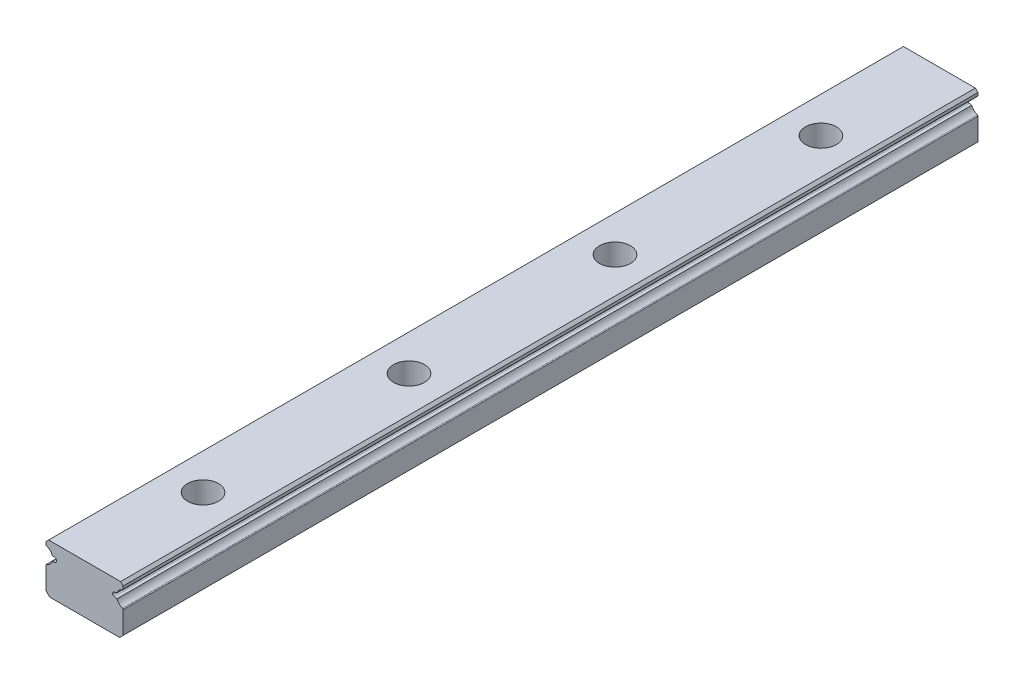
ISO-10303-21;
HEADER;
FILE_DESCRIPTION(('STEP AP214'),'2;1');
FILE_NAME('part.step','',(''),(''),'','','');
FILE_SCHEMA(('AUTOMOTIVE_DESIGN { 1 0 10303 214 1 1 1 1 }'));
ENDSEC;
DATA;
#1=APPLICATION_CONTEXT('core data for automotive mechanical design processes');
#2=APPLICATION_PROTOCOL_DEFINITION('international standard','automotive_design',2000,#1);
#3=PRODUCT_CONTEXT('',#1,'mechanical');
#4=PRODUCT('Part','Part','',(#3));
#5=PRODUCT_RELATED_PRODUCT_CATEGORY('part','',(#4));
#6=PRODUCT_DEFINITION_FORMATION('','',#4);
#7=PRODUCT_DEFINITION_CONTEXT('part definition',#1,'design');
#8=PRODUCT_DEFINITION('design','',#6,#7);
#9=PRODUCT_DEFINITION_SHAPE('','',#8);
#10=(LENGTH_UNIT() NAMED_UNIT(*) SI_UNIT(.MILLI.,.METRE.));
#11=(NAMED_UNIT(*) PLANE_ANGLE_UNIT() SI_UNIT($,.RADIAN.));
#12=(NAMED_UNIT(*) SI_UNIT($,.STERADIAN.) SOLID_ANGLE_UNIT());
#13=UNCERTAINTY_MEASURE_WITH_UNIT(LENGTH_MEASURE(1.E-05),#10,'distance_accuracy_value','');
#14=(GEOMETRIC_REPRESENTATION_CONTEXT(3) GLOBAL_UNCERTAINTY_ASSIGNED_CONTEXT((#13)) GLOBAL_UNIT_ASSIGNED_CONTEXT((#10,
#11,#12)) REPRESENTATION_CONTEXT('',''));
#15=CARTESIAN_POINT('',(0.,0.,0.));
#16=DIRECTION('',(0.,0.,1.));
#17=DIRECTION('',(1.,0.,0.));
#18=AXIS2_PLACEMENT_3D('',#15,#16,#17);
#19=CARTESIAN_POINT('',(-6.27999999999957,-8.749,-166.));
#20=DIRECTION('',(-0.209659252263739,-0.977774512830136,0.));
#21=DIRECTION('',(0.977774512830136,-0.209659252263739,0.));
#22=AXIS2_PLACEMENT_3D('',#19,#20,#21);
#23=PLANE('',#22);
#24=DIRECTION('',(0.977774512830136,-0.209659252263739,0.));
#25=VECTOR('',#24,1.);
#26=CARTESIAN_POINT('',(-6.27999999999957,-8.749,-166.));
#27=LINE('',#26,#25);
#28=CARTESIAN_POINT('',(-6.27999999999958,-8.749,-166.));
#29=VERTEX_POINT('',#28);
#30=CARTESIAN_POINT('',(-5.76751090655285,-8.85889044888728,-166.));
#31=VERTEX_POINT('',#30);
#32=EDGE_CURVE('E211',#29,#31,#27,.T.);
#33=ORIENTED_EDGE('',*,*,#32,.T.);
#34=DIRECTION('',(0.,0.,-1.));
#35=VECTOR('',#34,1.);
#36=CARTESIAN_POINT('',(-5.76751053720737,-8.85889052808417,-166.));
#37=LINE('',#36,#35);
#38=CARTESIAN_POINT('',(-5.76751090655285,-8.85889044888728,0.));
#39=VERTEX_POINT('',#38);
#40=EDGE_CURVE('E182',#31,#39,#37,.F.);
#41=ORIENTED_EDGE('',*,*,#40,.T.);
#42=DIRECTION('',(0.977774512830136,-0.209659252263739,0.));
#43=VECTOR('',#42,1.);
#44=CARTESIAN_POINT('',(-6.27999999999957,-8.749,0.));
#45=LINE('',#44,#43);
#46=CARTESIAN_POINT('',(-6.27999999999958,-8.749,0.));
#47=VERTEX_POINT('',#46);
#48=EDGE_CURVE('E219',#39,#47,#45,.F.);
#49=ORIENTED_EDGE('',*,*,#48,.T.);
#50=DIRECTION('',(0.,0.,-1.));
#51=VECTOR('',#50,1.);
#52=CARTESIAN_POINT('',(-6.27999999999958,-8.749,-166.));
#53=LINE('',#52,#51);
#54=EDGE_CURVE('E214',#47,#29,#53,.T.);
#55=ORIENTED_EDGE('',*,*,#54,.T.);
#56=EDGE_LOOP('',(#33,#41,#49,#55));
#57=FACE_BOUND('',#56,.T.);
#58=ADVANCED_FACE('F16',(#57),#23,.T.);
#59=CARTESIAN_POINT('',(5.7675105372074,-8.85889052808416,-166.));
#60=DIRECTION('',(0.20965925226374,-0.977774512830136,0.));
#61=DIRECTION('',(0.977774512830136,0.20965925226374,0.));
#62=AXIS2_PLACEMENT_3D('',#59,#60,#61);
#63=PLANE('',#62);
#64=DIRECTION('',(0.977774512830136,0.20965925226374,0.));
#65=VECTOR('',#64,1.);
#66=CARTESIAN_POINT('',(5.7675105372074,-8.85889052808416,-166.));
#67=LINE('',#66,#65);
#68=CARTESIAN_POINT('',(5.76751090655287,-8.85889044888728,-166.));
#69=VERTEX_POINT('',#68);
#70=CARTESIAN_POINT('',(6.27999999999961,-8.749,-166.));
#71=VERTEX_POINT('',#70);
#72=EDGE_CURVE('E184',#69,#71,#67,.T.);
#73=ORIENTED_EDGE('',*,*,#72,.T.);
#74=DIRECTION('',(0.,0.,-1.));
#75=VECTOR('',#74,1.);
#76=CARTESIAN_POINT('',(6.27999999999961,-8.749,-166.));
#77=LINE('',#76,#75);
#78=CARTESIAN_POINT('',(6.27999999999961,-8.749,0.));
#79=VERTEX_POINT('',#78);
#80=EDGE_CURVE('E222',#71,#79,#77,.F.);
#81=ORIENTED_EDGE('',*,*,#80,.T.);
#82=DIRECTION('',(0.977774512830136,0.20965925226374,0.));
#83=VECTOR('',#82,1.);
#84=CARTESIAN_POINT('',(5.7675105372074,-8.85889052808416,0.));
#85=LINE('',#84,#83);
#86=CARTESIAN_POINT('',(5.76751090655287,-8.85889044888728,0.));
#87=VERTEX_POINT('',#86);
#88=EDGE_CURVE('E209',#79,#87,#85,.F.);
#89=ORIENTED_EDGE('',*,*,#88,.T.);
#90=DIRECTION('',(0.,0.,-1.));
#91=VECTOR('',#90,1.);
#92=CARTESIAN_POINT('',(5.7675105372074,-8.85889052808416,-166.));
#93=LINE('',#92,#91);
#94=EDGE_CURVE('E204',#87,#69,#93,.T.);
#95=ORIENTED_EDGE('',*,*,#94,.T.);
#96=EDGE_LOOP('',(#73,#81,#89,#95));
#97=FACE_BOUND('',#96,.T.);
#98=ADVANCED_FACE('F834',(#97),#63,.T.);
#99=CARTESIAN_POINT('',(-5.85137497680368,-9.25000017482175,-166.));
#100=DIRECTION('',(0.,0.,-1.));
#101=DIRECTION('',(-1.,0.,0.));
#102=AXIS2_PLACEMENT_3D('',#99,#100,#101);
#103=CYLINDRICAL_SURFACE('',#102,0.4);
#104=ORIENTED_EDGE('',*,*,#40,.F.);
#105=CARTESIAN_POINT('',(-5.85137497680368,-9.25000017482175,-166.));
#106=DIRECTION('',(0.,0.,-1.));
#107=DIRECTION('',(-1.,0.,0.));
#108=AXIS2_PLACEMENT_3D('',#105,#106,#107);
#109=CIRCLE('',#108,0.4);
#110=CARTESIAN_POINT('',(-5.767,-9.641,-166.));
#111=VERTEX_POINT('',#110);
#112=EDGE_CURVE('E19',#111,#31,#109,.F.);
#113=ORIENTED_EDGE('',*,*,#112,.F.);
#114=DIRECTION('',(0.,0.,1.));
#115=VECTOR('',#114,1.);
#116=CARTESIAN_POINT('',(-5.767,-9.641,-166.));
#117=LINE('',#116,#115);
#118=CARTESIAN_POINT('',(-5.767,-9.641,0.));
#119=VERTEX_POINT('',#118);
#120=EDGE_CURVE('E179',#119,#111,#117,.F.);
#121=ORIENTED_EDGE('',*,*,#120,.F.);
#122=CARTESIAN_POINT('',(-5.85137497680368,-9.25000017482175,0.));
#123=DIRECTION('',(0.,0.,-1.));
#124=DIRECTION('',(-1.,0.,0.));
#125=AXIS2_PLACEMENT_3D('',#122,#123,#124);
#126=CIRCLE('',#125,0.4);
#127=EDGE_CURVE('E226',#39,#119,#126,.T.);
#128=ORIENTED_EDGE('',*,*,#127,.F.);
#129=EDGE_LOOP('',(#104,#113,#121,#128));
#130=FACE_BOUND('',#129,.T.);
#131=ADVANCED_FACE('F176',(#130),#103,.F.);
#132=CARTESIAN_POINT('',(7.89004225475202,-9.33975285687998,-166.));
#133=DIRECTION('',(0.,0.,-1.));
#134=DIRECTION('',(-1.,0.,0.));
#135=AXIS2_PLACEMENT_3D('',#132,#133,#134);
#136=CYLINDRICAL_SURFACE('',#135,1.715);
#137=ORIENTED_EDGE('',*,*,#80,.F.);
#138=CARTESIAN_POINT('',(7.89004225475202,-9.33975285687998,-166.));
#139=DIRECTION('',(0.,0.,-1.));
#140=DIRECTION('',(-1.,0.,0.));
#141=AXIS2_PLACEMENT_3D('',#138,#139,#140);
#142=CIRCLE('',#141,1.715);
#143=CARTESIAN_POINT('',(7.35000000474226,-7.71199999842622,-166.));
#144=VERTEX_POINT('',#143);
#145=EDGE_CURVE('E225',#144,#71,#142,.F.);
#146=ORIENTED_EDGE('',*,*,#145,.F.);
#147=DIRECTION('',(0.,0.,-1.));
#148=VECTOR('',#147,1.);
#149=CARTESIAN_POINT('',(7.35000000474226,-7.71199999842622,-166.));
#150=LINE('',#149,#148);
#151=CARTESIAN_POINT('',(7.35000000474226,-7.71199999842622,0.));
#152=VERTEX_POINT('',#151);
#153=EDGE_CURVE('E202',#152,#144,#150,.T.);
#154=ORIENTED_EDGE('',*,*,#153,.F.);
#155=CARTESIAN_POINT('',(7.89004225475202,-9.33975285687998,0.));
#156=DIRECTION('',(0.,0.,-1.));
#157=DIRECTION('',(-1.,0.,0.));
#158=AXIS2_PLACEMENT_3D('',#155,#156,#157);
#159=CIRCLE('',#158,1.715);
#160=EDGE_CURVE('E218',#79,#152,#159,.T.);
#161=ORIENTED_EDGE('',*,*,#160,.F.);
#162=EDGE_LOOP('',(#137,#146,#154,#161));
#163=FACE_BOUND('',#162,.T.);
#164=ADVANCED_FACE('F818',(#163),#136,.F.);
#165=CARTESIAN_POINT('',(-7.890042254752,-9.33975285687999,-166.));
#166=DIRECTION('',(0.,0.,-1.));
#167=DIRECTION('',(-1.,0.,0.));
#168=AXIS2_PLACEMENT_3D('',#165,#166,#167);
#169=CYLINDRICAL_SURFACE('',#168,1.715);
#170=DIRECTION('',(0.,0.,-1.));
#171=VECTOR('',#170,1.);
#172=CARTESIAN_POINT('',(-7.34999999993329,-7.7120000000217,-166.));
#173=LINE('',#172,#171);
#174=CARTESIAN_POINT('',(-7.34999999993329,-7.71200000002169,-166.));
#175=VERTEX_POINT('',#174);
#176=CARTESIAN_POINT('',(-7.34999999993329,-7.7120000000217,0.));
#177=VERTEX_POINT('',#176);
#178=EDGE_CURVE('E309',#175,#177,#173,.F.);
#179=ORIENTED_EDGE('',*,*,#178,.F.);
#180=CARTESIAN_POINT('',(-7.890042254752,-9.33975285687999,-166.));
#181=DIRECTION('',(0.,0.,-1.));
#182=DIRECTION('',(-1.,0.,0.));
#183=AXIS2_PLACEMENT_3D('',#180,#181,#182);
#184=CIRCLE('',#183,1.715);
#185=EDGE_CURVE('E217',#29,#175,#184,.F.);
#186=ORIENTED_EDGE('',*,*,#185,.F.);
#187=ORIENTED_EDGE('',*,*,#54,.F.);
#188=CARTESIAN_POINT('',(-7.890042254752,-9.33975285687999,0.));
#189=DIRECTION('',(0.,0.,-1.));
#190=DIRECTION('',(-1.,0.,0.));
#191=AXIS2_PLACEMENT_3D('',#188,#189,#190);
#192=CIRCLE('',#191,1.715);
#193=EDGE_CURVE('E208',#177,#47,#192,.T.);
#194=ORIENTED_EDGE('',*,*,#193,.F.);
#195=EDGE_LOOP('',(#179,#186,#187,#194));
#196=FACE_BOUND('',#195,.T.);
#197=ADVANCED_FACE('F334',(#196),#169,.F.);
#198=CARTESIAN_POINT('',(5.85137497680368,-9.25000017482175,-166.));
#199=DIRECTION('',(0.,0.,-1.));
#200=DIRECTION('',(-1.,0.,0.));
#201=AXIS2_PLACEMENT_3D('',#198,#199,#200);
#202=CYLINDRICAL_SURFACE('',#201,0.4);
#203=DIRECTION('',(0.,0.,1.));
#204=VECTOR('',#203,1.);
#205=CARTESIAN_POINT('',(5.767,-9.641,-166.));
#206=LINE('',#205,#204);
#207=CARTESIAN_POINT('',(5.767,-9.641,-166.));
#208=VERTEX_POINT('',#207);
#209=CARTESIAN_POINT('',(5.767,-9.641,0.));
#210=VERTEX_POINT('',#209);
#211=EDGE_CURVE('E305',#208,#210,#206,.T.);
#212=ORIENTED_EDGE('',*,*,#211,.F.);
#213=CARTESIAN_POINT('',(5.85137497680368,-9.25000017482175,-166.));
#214=DIRECTION('',(0.,0.,-1.));
#215=DIRECTION('',(-1.,0.,0.));
#216=AXIS2_PLACEMENT_3D('',#213,#214,#215);
#217=CIRCLE('',#216,0.4);
#218=EDGE_CURVE('E207',#69,#208,#217,.F.);
#219=ORIENTED_EDGE('',*,*,#218,.F.);
#220=ORIENTED_EDGE('',*,*,#94,.F.);
#221=CARTESIAN_POINT('',(5.85137497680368,-9.25000017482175,0.));
#222=DIRECTION('',(0.,0.,-1.));
#223=DIRECTION('',(-1.,0.,0.));
#224=AXIS2_PLACEMENT_3D('',#221,#222,#223);
#225=CIRCLE('',#224,0.4);
#226=EDGE_CURVE('E198',#210,#87,#225,.T.);
#227=ORIENTED_EDGE('',*,*,#226,.F.);
#228=EDGE_LOOP('',(#212,#219,#220,#227));
#229=FACE_BOUND('',#228,.T.);
#230=ADVANCED_FACE('F802',(#229),#202,.F.);
#231=CARTESIAN_POINT('',(-5.767,-9.641,-166.));
#232=DIRECTION('',(-0.207835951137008,0.978163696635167,0.));
#233=DIRECTION('',(-0.978163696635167,-0.207835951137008,0.));
#234=AXIS2_PLACEMENT_3D('',#231,#232,#233);
#235=PLANE('',#234);
#236=DIRECTION('',(-0.978163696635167,-0.207835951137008,0.));
#237=VECTOR('',#236,1.);
#238=CARTESIAN_POINT('',(-5.767,-9.641,-166.));
#239=LINE('',#238,#237);
#240=CARTESIAN_POINT('',(-6.28,-9.75,-166.));
#241=VERTEX_POINT('',#240);
#242=EDGE_CURVE('E186',#111,#241,#239,.T.);
#243=ORIENTED_EDGE('',*,*,#242,.T.);
#244=DIRECTION('',(0.,0.,-1.));
#245=VECTOR('',#244,1.);
#246=CARTESIAN_POINT('',(-6.28,-9.75,-166.));
#247=LINE('',#246,#245);
#248=CARTESIAN_POINT('',(-6.28,-9.75,0.));
#249=VERTEX_POINT('',#248);
#250=EDGE_CURVE('E303',#241,#249,#247,.F.);
#251=ORIENTED_EDGE('',*,*,#250,.T.);
#252=DIRECTION('',(-0.978163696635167,-0.207835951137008,0.));
#253=VECTOR('',#252,1.);
#254=CARTESIAN_POINT('',(-5.767,-9.641,0.));
#255=LINE('',#254,#253);
#256=EDGE_CURVE('E196',#249,#119,#255,.F.);
#257=ORIENTED_EDGE('',*,*,#256,.T.);
#258=ORIENTED_EDGE('',*,*,#120,.T.);
#259=EDGE_LOOP('',(#243,#251,#257,#258));
#260=FACE_BOUND('',#259,.T.);
#261=ADVANCED_FACE('F195',(#260),#235,.T.);
#262=CARTESIAN_POINT('',(7.287,-7.52218166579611,-166.));
#263=DIRECTION('',(0.,0.,-1.));
#264=DIRECTION('',(-1.,0.,0.));
#265=AXIS2_PLACEMENT_3D('',#262,#263,#264);
#266=CYLINDRICAL_SURFACE('',#265,0.2);
#267=CARTESIAN_POINT('',(7.287,-7.52218166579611,-166.));
#268=DIRECTION('',(0.,0.,-1.));
#269=DIRECTION('',(-1.,0.,0.));
#270=AXIS2_PLACEMENT_3D('',#267,#268,#269);
#271=CIRCLE('',#270,0.2);
#272=CARTESIAN_POINT('',(7.487,-7.52218165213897,-166.));
#273=VERTEX_POINT('',#272);
#274=EDGE_CURVE('E313',#144,#273,#271,.F.);
#275=ORIENTED_EDGE('',*,*,#274,.T.);
#276=DIRECTION('',(0.,0.,-1.));
#277=VECTOR('',#276,1.);
#278=CARTESIAN_POINT('',(7.487,-7.52218163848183,-166.));
#279=LINE('',#278,#277);
#280=CARTESIAN_POINT('',(7.487,-7.52218165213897,0.));
#281=VERTEX_POINT('',#280);
#282=EDGE_CURVE('E371',#281,#273,#279,.T.);
#283=ORIENTED_EDGE('',*,*,#282,.F.);
#284=CARTESIAN_POINT('',(7.287,-7.52218166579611,0.));
#285=DIRECTION('',(0.,0.,-1.));
#286=DIRECTION('',(-1.,0.,0.));
#287=AXIS2_PLACEMENT_3D('',#284,#285,#286);
#288=CIRCLE('',#287,0.2);
#289=EDGE_CURVE('E193',#281,#152,#288,.T.);
#290=ORIENTED_EDGE('',*,*,#289,.T.);
#291=ORIENTED_EDGE('',*,*,#153,.T.);
#292=EDGE_LOOP('',(#275,#283,#290,#291));
#293=FACE_BOUND('',#292,.T.);
#294=ADVANCED_FACE('F787',(#293),#266,.T.);
#295=CARTESIAN_POINT('',(-7.288,-7.52185268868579,-166.));
#296=DIRECTION('',(0.,0.,-1.));
#297=DIRECTION('',(-1.,0.,0.));
#298=AXIS2_PLACEMENT_3D('',#295,#296,#297);
#299=CYLINDRICAL_SURFACE('',#298,0.200000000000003);
#300=CARTESIAN_POINT('',(-7.288,-7.52185268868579,-166.));
#301=DIRECTION('',(0.,0.,-1.));
#302=DIRECTION('',(-1.,0.,0.));
#303=AXIS2_PLACEMENT_3D('',#300,#301,#302);
#304=CIRCLE('',#303,0.200000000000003);
#305=CARTESIAN_POINT('',(-7.488,-7.52185267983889,-166.));
#306=VERTEX_POINT('',#305);
#307=EDGE_CURVE('E306',#306,#175,#304,.F.);
#308=ORIENTED_EDGE('',*,*,#307,.T.);
#309=ORIENTED_EDGE('',*,*,#178,.T.);
#310=CARTESIAN_POINT('',(-7.288,-7.52185268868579,0.));
#311=DIRECTION('',(0.,0.,-1.));
#312=DIRECTION('',(-1.,0.,0.));
#313=AXIS2_PLACEMENT_3D('',#310,#311,#312);
#314=CIRCLE('',#313,0.200000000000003);
#315=CARTESIAN_POINT('',(-7.488,-7.52185267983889,0.));
#316=VERTEX_POINT('',#315);
#317=EDGE_CURVE('E310',#177,#316,#314,.T.);
#318=ORIENTED_EDGE('',*,*,#317,.T.);
#319=DIRECTION('',(0.,0.,1.));
#320=VECTOR('',#319,1.);
#321=CARTESIAN_POINT('',(-7.488,-7.52185267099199,-166.));
#322=LINE('',#321,#320);
#323=EDGE_CURVE('E339',#306,#316,#322,.T.);
#324=ORIENTED_EDGE('',*,*,#323,.F.);
#325=EDGE_LOOP('',(#308,#309,#318,#324));
#326=FACE_BOUND('',#325,.T.);
#327=ADVANCED_FACE('F337',(#326),#299,.T.);
#328=CARTESIAN_POINT('',(6.28,-9.75,-166.));
#329=DIRECTION('',(0.207835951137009,0.978163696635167,0.));
#330=DIRECTION('',(-0.978163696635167,0.207835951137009,0.));
#331=AXIS2_PLACEMENT_3D('',#328,#329,#330);
#332=PLANE('',#331);
#333=DIRECTION('',(-0.978163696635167,0.207835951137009,0.));
#334=VECTOR('',#333,1.);
#335=CARTESIAN_POINT('',(6.28,-9.75,-166.));
#336=LINE('',#335,#334);
#337=CARTESIAN_POINT('',(6.28,-9.75,-166.));
#338=VERTEX_POINT('',#337);
#339=EDGE_CURVE('E395',#338,#208,#336,.T.);
#340=ORIENTED_EDGE('',*,*,#339,.T.);
#341=ORIENTED_EDGE('',*,*,#211,.T.);
#342=DIRECTION('',(-0.978163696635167,0.207835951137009,0.));
#343=VECTOR('',#342,1.);
#344=CARTESIAN_POINT('',(6.28,-9.75,0.));
#345=LINE('',#344,#343);
#346=CARTESIAN_POINT('',(6.28,-9.75,0.));
#347=VERTEX_POINT('',#346);
#348=EDGE_CURVE('E336',#210,#347,#345,.F.);
#349=ORIENTED_EDGE('',*,*,#348,.T.);
#350=DIRECTION('',(0.,0.,-1.));
#351=VECTOR('',#350,1.);
#352=CARTESIAN_POINT('',(6.28,-9.75,-166.));
#353=LINE('',#352,#351);
#354=EDGE_CURVE('E299',#347,#338,#353,.T.);
#355=ORIENTED_EDGE('',*,*,#354,.T.);
#356=EDGE_LOOP('',(#340,#341,#349,#355));
#357=FACE_BOUND('',#356,.T.);
#358=ADVANCED_FACE('F502',(#357),#332,.T.);
#359=CARTESIAN_POINT('',(-7.89007044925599,-9.159323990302,-166.));
#360=DIRECTION('',(0.,0.,-1.));
#361=DIRECTION('',(-1.,0.,0.));
#362=AXIS2_PLACEMENT_3D('',#359,#360,#361);
#363=CYLINDRICAL_SURFACE('',#362,1.715);
#364=ORIENTED_EDGE('',*,*,#250,.F.);
#365=CARTESIAN_POINT('',(-7.89007044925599,-9.159323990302,-166.));
#366=DIRECTION('',(0.,0.,-1.));
#367=DIRECTION('',(-1.,0.,0.));
#368=AXIS2_PLACEMENT_3D('',#365,#366,#367);
#369=CIRCLE('',#368,1.715);
#370=CARTESIAN_POINT('',(-7.36199999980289,-10.7909999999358,-166.));
#371=VERTEX_POINT('',#370);
#372=EDGE_CURVE('E189',#371,#241,#369,.F.);
#373=ORIENTED_EDGE('',*,*,#372,.F.);
#374=DIRECTION('',(0.,0.,-1.));
#375=VECTOR('',#374,1.);
#376=CARTESIAN_POINT('',(-7.36199999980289,-10.7909999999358,-166.));
#377=LINE('',#376,#375);
#378=CARTESIAN_POINT('',(-7.36199999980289,-10.7909999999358,0.));
#379=VERTEX_POINT('',#378);
#380=EDGE_CURVE('E290',#379,#371,#377,.T.);
#381=ORIENTED_EDGE('',*,*,#380,.F.);
#382=CARTESIAN_POINT('',(-7.89007044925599,-9.159323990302,0.));
#383=DIRECTION('',(0.,0.,-1.));
#384=DIRECTION('',(-1.,0.,0.));
#385=AXIS2_PLACEMENT_3D('',#382,#383,#384);
#386=CIRCLE('',#385,1.715);
#387=EDGE_CURVE('E300',#249,#379,#386,.T.);
#388=ORIENTED_EDGE('',*,*,#387,.F.);
#389=EDGE_LOOP('',(#364,#373,#381,#388));
#390=FACE_BOUND('',#389,.T.);
#391=ADVANCED_FACE('F499',(#390),#363,.F.);
#392=CARTESIAN_POINT('',(7.487,-7.52218163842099,-166.));
#393=DIRECTION('',(1.,0.,0.));
#394=DIRECTION('',(0.,0.,-1.));
#395=AXIS2_PLACEMENT_3D('',#392,#393,#394);
#396=PLANE('',#395);
#397=DIRECTION('',(0.,1.,0.));
#398=VECTOR('',#397,1.);
#399=CARTESIAN_POINT('',(7.487,-7.52218163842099,-166.));
#400=LINE('',#399,#398);
#401=CARTESIAN_POINT('',(7.487,-7.,-166.));
#402=VERTEX_POINT('',#401);
#403=EDGE_CURVE('E351',#273,#402,#400,.T.);
#404=ORIENTED_EDGE('',*,*,#403,.T.);
#405=DIRECTION('',(0.,0.,1.));
#406=VECTOR('',#405,1.);
#407=CARTESIAN_POINT('',(7.487,-7.,-166.));
#408=LINE('',#407,#406);
#409=CARTESIAN_POINT('',(7.487,-7.,0.));
#410=VERTEX_POINT('',#409);
#411=EDGE_CURVE('E378',#410,#402,#408,.F.);
#412=ORIENTED_EDGE('',*,*,#411,.F.);
#413=DIRECTION('',(0.,1.,0.));
#414=VECTOR('',#413,1.);
#415=CARTESIAN_POINT('',(7.487,-7.52218163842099,0.));
#416=LINE('',#415,#414);
#417=EDGE_CURVE('E302',#410,#281,#416,.F.);
#418=ORIENTED_EDGE('',*,*,#417,.T.);
#419=ORIENTED_EDGE('',*,*,#282,.T.);
#420=EDGE_LOOP('',(#404,#412,#418,#419));
#421=FACE_BOUND('',#420,.T.);
#422=ADVANCED_FACE('F501',(#421),#396,.T.);
#423=CARTESIAN_POINT('',(-7.488,-7.,-166.));
#424=DIRECTION('',(-1.,0.,0.));
#425=DIRECTION('',(0.,0.,1.));
#426=AXIS2_PLACEMENT_3D('',#423,#424,#425);
#427=PLANE('',#426);
#428=DIRECTION('',(0.,1.,0.));
#429=VECTOR('',#428,1.);
#430=CARTESIAN_POINT('',(-7.488,-7.,-166.));
#431=LINE('',#430,#429);
#432=CARTESIAN_POINT('',(-7.488,-7.,-166.));
#433=VERTEX_POINT('',#432);
#434=EDGE_CURVE('E343',#433,#306,#431,.F.);
#435=ORIENTED_EDGE('',*,*,#434,.T.);
#436=ORIENTED_EDGE('',*,*,#323,.T.);
#437=DIRECTION('',(0.,1.,0.));
#438=VECTOR('',#437,1.);
#439=CARTESIAN_POINT('',(-7.488,-7.,0.));
#440=LINE('',#439,#438);
#441=CARTESIAN_POINT('',(-7.488,-7.,0.));
#442=VERTEX_POINT('',#441);
#443=EDGE_CURVE('E349',#316,#442,#440,.T.);
#444=ORIENTED_EDGE('',*,*,#443,.T.);
#445=DIRECTION('',(0.,0.,1.));
#446=VECTOR('',#445,1.);
#447=CARTESIAN_POINT('',(-7.488,-7.,-166.));
#448=LINE('',#447,#446);
#449=EDGE_CURVE('E286',#433,#442,#448,.T.);
#450=ORIENTED_EDGE('',*,*,#449,.F.);
#451=EDGE_LOOP('',(#435,#436,#444,#450));
#452=FACE_BOUND('',#451,.T.);
#453=ADVANCED_FACE('F346',(#452),#427,.T.);
#454=CARTESIAN_POINT('',(7.890070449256,-9.159323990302,-166.));
#455=DIRECTION('',(0.,0.,-1.));
#456=DIRECTION('',(-1.,0.,0.));
#457=AXIS2_PLACEMENT_3D('',#454,#455,#456);
#458=CYLINDRICAL_SURFACE('',#457,1.715);
#459=DIRECTION('',(0.,0.,-1.));
#460=VECTOR('',#459,1.);
#461=CARTESIAN_POINT('',(7.36199999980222,-10.7909999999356,-166.));
#462=LINE('',#461,#460);
#463=CARTESIAN_POINT('',(7.36199999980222,-10.7909999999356,-166.));
#464=VERTEX_POINT('',#463);
#465=CARTESIAN_POINT('',(7.36199999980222,-10.7909999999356,0.));
#466=VERTEX_POINT('',#465);
#467=EDGE_CURVE('E280',#464,#466,#462,.F.);
#468=ORIENTED_EDGE('',*,*,#467,.F.);
#469=CARTESIAN_POINT('',(7.890070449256,-9.159323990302,-166.));
#470=DIRECTION('',(0.,0.,-1.));
#471=DIRECTION('',(-1.,0.,0.));
#472=AXIS2_PLACEMENT_3D('',#469,#470,#471);
#473=CIRCLE('',#472,1.715);
#474=EDGE_CURVE('E297',#338,#464,#473,.F.);
#475=ORIENTED_EDGE('',*,*,#474,.F.);
#476=ORIENTED_EDGE('',*,*,#354,.F.);
#477=CARTESIAN_POINT('',(7.890070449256,-9.159323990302,0.));
#478=DIRECTION('',(0.,0.,-1.));
#479=DIRECTION('',(-1.,0.,0.));
#480=AXIS2_PLACEMENT_3D('',#477,#478,#479);
#481=CIRCLE('',#480,1.715);
#482=EDGE_CURVE('E294',#466,#347,#481,.T.);
#483=ORIENTED_EDGE('',*,*,#482,.F.);
#484=EDGE_LOOP('',(#468,#475,#476,#483));
#485=FACE_BOUND('',#484,.T.);
#486=ADVANCED_FACE('F601',(#485),#458,.F.);
#487=CARTESIAN_POINT('',(-7.3,-10.9811473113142,-166.));
#488=DIRECTION('',(0.,0.,-1.));
#489=DIRECTION('',(-1.,0.,0.));
#490=AXIS2_PLACEMENT_3D('',#487,#488,#489);
#491=CYLINDRICAL_SURFACE('',#490,0.200000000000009);
#492=CARTESIAN_POINT('',(-7.3,-10.9811473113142,-166.));
#493=DIRECTION('',(0.,0.,-1.));
#494=DIRECTION('',(-1.,0.,0.));
#495=AXIS2_PLACEMENT_3D('',#492,#493,#494);
#496=CIRCLE('',#495,0.200000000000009);
#497=CARTESIAN_POINT('',(-7.5,-10.9811473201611,-166.));
#498=VERTEX_POINT('',#497);
#499=EDGE_CURVE('E287',#371,#498,#496,.F.);
#500=ORIENTED_EDGE('',*,*,#499,.T.);
#501=DIRECTION('',(0.,0.,1.));
#502=VECTOR('',#501,1.);
#503=CARTESIAN_POINT('',(-7.5,-10.981147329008,-166.));
#504=LINE('',#503,#502);
#505=CARTESIAN_POINT('',(-7.5,-10.9811473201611,0.));
#506=VERTEX_POINT('',#505);
#507=EDGE_CURVE('E273',#506,#498,#504,.F.);
#508=ORIENTED_EDGE('',*,*,#507,.F.);
#509=CARTESIAN_POINT('',(-7.3,-10.9811473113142,0.));
#510=DIRECTION('',(0.,0.,-1.));
#511=DIRECTION('',(-1.,0.,0.));
#512=AXIS2_PLACEMENT_3D('',#509,#510,#511);
#513=CIRCLE('',#512,0.200000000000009);
#514=EDGE_CURVE('E291',#506,#379,#513,.T.);
#515=ORIENTED_EDGE('',*,*,#514,.T.);
#516=ORIENTED_EDGE('',*,*,#380,.T.);
#517=EDGE_LOOP('',(#500,#508,#515,#516));
#518=FACE_BOUND('',#517,.T.);
#519=ADVANCED_FACE('F495',(#518),#491,.T.);
#520=CARTESIAN_POINT('',(0.,-16.,-103.));
#521=DIRECTION('',(0.,1.,0.));
#522=DIRECTION('',(0.,0.,1.));
#523=AXIS2_PLACEMENT_3D('',#520,#521,#522);
#524=CYLINDRICAL_SURFACE('',#523,3.);
#525=CARTESIAN_POINT('',(0.,-6.5,-103.));
#526=DIRECTION('',(0.,1.,0.));
#527=DIRECTION('',(0.,0.,1.));
#528=AXIS2_PLACEMENT_3D('',#525,#526,#527);
#529=CIRCLE('',#528,3.);
#530=CARTESIAN_POINT('',(0.,-6.5,-100.));
#531=VERTEX_POINT('',#530);
#532=EDGE_CURVE('E270',#531,#531,#529,.F.);
#533=ORIENTED_EDGE('',*,*,#532,.F.);
#534=EDGE_LOOP('',(#533));
#535=FACE_BOUND('',#534,.T.);
#536=CARTESIAN_POINT('',(0.,-11.,-103.));
#537=DIRECTION('',(0.,1.,0.));
#538=DIRECTION('',(0.,0.,1.));
#539=AXIS2_PLACEMENT_3D('',#536,#537,#538);
#540=CIRCLE('',#539,3.);
#541=CARTESIAN_POINT('',(0.,-11.,-100.));
#542=VERTEX_POINT('',#541);
#543=EDGE_CURVE('E277',#542,#542,#540,.T.);
#544=ORIENTED_EDGE('',*,*,#543,.F.);
#545=EDGE_LOOP('',(#544));
#546=FACE_BOUND('',#545,.T.);
#547=ADVANCED_FACE('F594',(#535,#546),#524,.F.);
#548=CARTESIAN_POINT('',(0.,-16.,-23.));
#549=DIRECTION('',(0.,1.,0.));
#550=DIRECTION('',(0.,0.,1.));
#551=AXIS2_PLACEMENT_3D('',#548,#549,#550);
#552=CYLINDRICAL_SURFACE('',#551,3.);
#553=CARTESIAN_POINT('',(0.,-6.5,-23.));
#554=DIRECTION('',(0.,1.,0.));
#555=DIRECTION('',(0.,0.,1.));
#556=AXIS2_PLACEMENT_3D('',#553,#554,#555);
#557=CIRCLE('',#556,3.);
#558=CARTESIAN_POINT('',(0.,-6.5,-20.));
#559=VERTEX_POINT('',#558);
#560=EDGE_CURVE('E266',#559,#559,#557,.F.);
#561=ORIENTED_EDGE('',*,*,#560,.F.);
#562=EDGE_LOOP('',(#561));
#563=FACE_BOUND('',#562,.T.);
#564=CARTESIAN_POINT('',(0.,-11.,-23.));
#565=DIRECTION('',(0.,1.,0.));
#566=DIRECTION('',(0.,0.,1.));
#567=AXIS2_PLACEMENT_3D('',#564,#565,#566);
#568=CIRCLE('',#567,3.);
#569=CARTESIAN_POINT('',(0.,-11.,-20.));
#570=VERTEX_POINT('',#569);
#571=EDGE_CURVE('E274',#570,#570,#568,.T.);
#572=ORIENTED_EDGE('',*,*,#571,.F.);
#573=EDGE_LOOP('',(#572));
#574=FACE_BOUND('',#573,.T.);
#575=ADVANCED_FACE('F590',(#563,#574),#552,.F.);
#576=CARTESIAN_POINT('',(7.487,-7.,-166.));
#577=DIRECTION('',(0.707106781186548,0.707106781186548,0.));
#578=DIRECTION('',(-0.707106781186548,0.707106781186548,0.));
#579=AXIS2_PLACEMENT_3D('',#576,#577,#578);
#580=PLANE('',#579);
#581=DIRECTION('',(-0.707106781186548,0.707106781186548,0.));
#582=VECTOR('',#581,1.);
#583=CARTESIAN_POINT('',(7.487,-7.,-166.));
#584=LINE('',#583,#582);
#585=CARTESIAN_POINT('',(6.987,-6.5,-166.));
#586=VERTEX_POINT('',#585);
#587=EDGE_CURVE('E368',#402,#586,#584,.T.);
#588=ORIENTED_EDGE('',*,*,#587,.T.);
#589=DIRECTION('',(0.,0.,1.));
#590=VECTOR('',#589,1.);
#591=CARTESIAN_POINT('',(6.987,-6.5,-166.));
#592=LINE('',#591,#590);
#593=CARTESIAN_POINT('',(6.987,-6.5,0.));
#594=VERTEX_POINT('',#593);
#595=EDGE_CURVE('E269',#594,#586,#592,.F.);
#596=ORIENTED_EDGE('',*,*,#595,.F.);
#597=DIRECTION('',(-0.707106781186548,0.707106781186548,0.));
#598=VECTOR('',#597,1.);
#599=CARTESIAN_POINT('',(7.487,-7.,0.));
#600=LINE('',#599,#598);
#601=EDGE_CURVE('E289',#594,#410,#600,.F.);
#602=ORIENTED_EDGE('',*,*,#601,.T.);
#603=ORIENTED_EDGE('',*,*,#411,.T.);
#604=EDGE_LOOP('',(#588,#596,#602,#603));
#605=FACE_BOUND('',#604,.T.);
#606=ADVANCED_FACE('F586',(#605),#580,.T.);
#607=CARTESIAN_POINT('',(-6.988,-6.5,-166.));
#608=DIRECTION('',(-0.707106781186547,0.707106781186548,0.));
#609=DIRECTION('',(-0.707106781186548,-0.707106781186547,0.));
#610=AXIS2_PLACEMENT_3D('',#607,#608,#609);
#611=PLANE('',#610);
#612=DIRECTION('',(-0.707106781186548,-0.707106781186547,0.));
#613=VECTOR('',#612,1.);
#614=CARTESIAN_POINT('',(-6.988,-6.5,-166.));
#615=LINE('',#614,#613);
#616=CARTESIAN_POINT('',(-6.988,-6.5,-166.));
#617=VERTEX_POINT('',#616);
#618=EDGE_CURVE('E358',#617,#433,#615,.T.);
#619=ORIENTED_EDGE('',*,*,#618,.T.);
#620=ORIENTED_EDGE('',*,*,#449,.T.);
#621=DIRECTION('',(-0.707106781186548,-0.707106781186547,0.));
#622=VECTOR('',#621,1.);
#623=CARTESIAN_POINT('',(-6.988,-6.5,0.));
#624=LINE('',#623,#622);
#625=CARTESIAN_POINT('',(-6.988,-6.5,0.));
#626=VERTEX_POINT('',#625);
#627=EDGE_CURVE('E362',#442,#626,#624,.F.);
#628=ORIENTED_EDGE('',*,*,#627,.T.);
#629=DIRECTION('',(0.,0.,1.));
#630=VECTOR('',#629,1.);
#631=CARTESIAN_POINT('',(-6.988,-6.5,-166.));
#632=LINE('',#631,#630);
#633=EDGE_CURVE('E265',#617,#626,#632,.T.);
#634=ORIENTED_EDGE('',*,*,#633,.F.);
#635=EDGE_LOOP('',(#619,#620,#628,#634));
#636=FACE_BOUND('',#635,.T.);
#637=ADVANCED_FACE('F582',(#636),#611,.T.);
#638=CARTESIAN_POINT('',(7.3,-10.9811473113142,-166.));
#639=DIRECTION('',(0.,0.,-1.));
#640=DIRECTION('',(-1.,0.,0.));
#641=AXIS2_PLACEMENT_3D('',#638,#639,#640);
#642=CYLINDRICAL_SURFACE('',#641,0.2);
#643=CARTESIAN_POINT('',(7.3,-10.9811473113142,-166.));
#644=DIRECTION('',(0.,0.,-1.));
#645=DIRECTION('',(-1.,0.,0.));
#646=AXIS2_PLACEMENT_3D('',#643,#644,#645);
#647=CIRCLE('',#646,0.2);
#648=CARTESIAN_POINT('',(7.5,-10.9811473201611,-166.));
#649=VERTEX_POINT('',#648);
#650=EDGE_CURVE('E281',#649,#464,#647,.F.);
#651=ORIENTED_EDGE('',*,*,#650,.T.);
#652=ORIENTED_EDGE('',*,*,#467,.T.);
#653=CARTESIAN_POINT('',(7.3,-10.9811473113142,0.));
#654=DIRECTION('',(0.,0.,-1.));
#655=DIRECTION('',(-1.,0.,0.));
#656=AXIS2_PLACEMENT_3D('',#653,#654,#655);
#657=CIRCLE('',#656,0.2);
#658=CARTESIAN_POINT('',(7.5,-10.9811473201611,0.));
#659=VERTEX_POINT('',#658);
#660=EDGE_CURVE('E284',#466,#659,#657,.T.);
#661=ORIENTED_EDGE('',*,*,#660,.T.);
#662=DIRECTION('',(0.,0.,-1.));
#663=VECTOR('',#662,1.);
#664=CARTESIAN_POINT('',(7.5,-10.981147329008,-166.));
#665=LINE('',#664,#663);
#666=EDGE_CURVE('E258',#649,#659,#665,.F.);
#667=ORIENTED_EDGE('',*,*,#666,.F.);
#668=EDGE_LOOP('',(#651,#652,#661,#667));
#669=FACE_BOUND('',#668,.T.);
#670=ADVANCED_FACE('F578',(#669),#642,.T.);
#671=CARTESIAN_POINT('',(0.,-16.,-63.));
#672=DIRECTION('',(0.,1.,0.));
#673=DIRECTION('',(0.,0.,1.));
#674=AXIS2_PLACEMENT_3D('',#671,#672,#673);
#675=CYLINDRICAL_SURFACE('',#674,3.);
#676=CARTESIAN_POINT('',(0.,-6.5,-63.));
#677=DIRECTION('',(0.,1.,0.));
#678=DIRECTION('',(0.,0.,1.));
#679=AXIS2_PLACEMENT_3D('',#676,#677,#678);
#680=CIRCLE('',#679,3.);
#681=CARTESIAN_POINT('',(0.,-6.5,-60.));
#682=VERTEX_POINT('',#681);
#683=EDGE_CURVE('E262',#682,#682,#680,.F.);
#684=ORIENTED_EDGE('',*,*,#683,.F.);
#685=EDGE_LOOP('',(#684));
#686=FACE_BOUND('',#685,.T.);
#687=CARTESIAN_POINT('',(0.,-11.,-63.));
#688=DIRECTION('',(0.,1.,0.));
#689=DIRECTION('',(0.,0.,1.));
#690=AXIS2_PLACEMENT_3D('',#687,#688,#689);
#691=CIRCLE('',#690,3.);
#692=CARTESIAN_POINT('',(0.,-11.,-60.));
#693=VERTEX_POINT('',#692);
#694=EDGE_CURVE('E255',#693,#693,#691,.T.);
#695=ORIENTED_EDGE('',*,*,#694,.F.);
#696=EDGE_LOOP('',(#695));
#697=FACE_BOUND('',#696,.T.);
#698=ADVANCED_FACE('F574',(#686,#697),#675,.F.);
#699=CARTESIAN_POINT('',(0.,-16.,-143.));
#700=DIRECTION('',(0.,1.,0.));
#701=DIRECTION('',(0.,0.,1.));
#702=AXIS2_PLACEMENT_3D('',#699,#700,#701);
#703=CYLINDRICAL_SURFACE('',#702,3.);
#704=CARTESIAN_POINT('',(0.,-6.5,-143.));
#705=DIRECTION('',(0.,1.,0.));
#706=DIRECTION('',(0.,0.,1.));
#707=AXIS2_PLACEMENT_3D('',#704,#705,#706);
#708=CIRCLE('',#707,3.);
#709=CARTESIAN_POINT('',(0.,-6.5,-140.));
#710=VERTEX_POINT('',#709);
#711=EDGE_CURVE('E259',#710,#710,#708,.F.);
#712=ORIENTED_EDGE('',*,*,#711,.F.);
#713=EDGE_LOOP('',(#712));
#714=FACE_BOUND('',#713,.T.);
#715=CARTESIAN_POINT('',(0.,-11.,-143.));
#716=DIRECTION('',(0.,1.,0.));
#717=DIRECTION('',(0.,0.,1.));
#718=AXIS2_PLACEMENT_3D('',#715,#716,#717);
#719=CIRCLE('',#718,3.);
#720=CARTESIAN_POINT('',(0.,-11.,-140.));
#721=VERTEX_POINT('',#720);
#722=EDGE_CURVE('E252',#721,#721,#719,.T.);
#723=ORIENTED_EDGE('',*,*,#722,.F.);
#724=EDGE_LOOP('',(#723));
#725=FACE_BOUND('',#724,.T.);
#726=ADVANCED_FACE('F570',(#714,#725),#703,.F.);
#727=CARTESIAN_POINT('',(0.,-11.,-106.));
#728=DIRECTION('',(0.,1.,0.));
#729=DIRECTION('',(0.,0.,1.));
#730=AXIS2_PLACEMENT_3D('',#727,#728,#729);
#731=PLANE('',#730);
#732=ORIENTED_EDGE('',*,*,#543,.T.);
#733=EDGE_LOOP('',(#732));
#734=FACE_BOUND('',#733,.T.);
#735=CARTESIAN_POINT('',(0.,-11.,-103.));
#736=DIRECTION('',(0.,1.,0.));
#737=DIRECTION('',(0.,0.,1.));
#738=AXIS2_PLACEMENT_3D('',#735,#736,#737);
#739=CIRCLE('',#738,1.75);
#740=CARTESIAN_POINT('',(0.,-11.,-101.25));
#741=VERTEX_POINT('',#740);
#742=EDGE_CURVE('E249',#741,#741,#739,.F.);
#743=ORIENTED_EDGE('',*,*,#742,.T.);
#744=EDGE_LOOP('',(#743));
#745=FACE_BOUND('',#744,.T.);
#746=ADVANCED_FACE('F566',(#734,#745),#731,.T.);
#747=CARTESIAN_POINT('',(0.,-11.,-26.));
#748=DIRECTION('',(0.,1.,0.));
#749=DIRECTION('',(0.,0.,1.));
#750=AXIS2_PLACEMENT_3D('',#747,#748,#749);
#751=PLANE('',#750);
#752=ORIENTED_EDGE('',*,*,#571,.T.);
#753=EDGE_LOOP('',(#752));
#754=FACE_BOUND('',#753,.T.);
#755=CARTESIAN_POINT('',(0.,-11.,-23.));
#756=DIRECTION('',(0.,1.,0.));
#757=DIRECTION('',(0.,0.,1.));
#758=AXIS2_PLACEMENT_3D('',#755,#756,#757);
#759=CIRCLE('',#758,1.75);
#760=CARTESIAN_POINT('',(0.,-11.,-21.25));
#761=VERTEX_POINT('',#760);
#762=EDGE_CURVE('E245',#761,#761,#759,.F.);
#763=ORIENTED_EDGE('',*,*,#762,.T.);
#764=EDGE_LOOP('',(#763));
#765=FACE_BOUND('',#764,.T.);
#766=ADVANCED_FACE('F563',(#754,#765),#751,.T.);
#767=CARTESIAN_POINT('',(-7.5,-10.981147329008,-166.));
#768=DIRECTION('',(-1.,0.,0.));
#769=DIRECTION('',(0.,0.,1.));
#770=AXIS2_PLACEMENT_3D('',#767,#768,#769);
#771=PLANE('',#770);
#772=DIRECTION('',(0.,1.,0.));
#773=VECTOR('',#772,1.);
#774=CARTESIAN_POINT('',(-7.5,-10.9811473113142,-166.));
#775=LINE('',#774,#773);
#776=CARTESIAN_POINT('',(-7.5,-15.3,-166.));
#777=VERTEX_POINT('',#776);
#778=EDGE_CURVE('E435',#498,#777,#775,.F.);
#779=ORIENTED_EDGE('',*,*,#778,.T.);
#780=DIRECTION('',(0.,0.,1.));
#781=VECTOR('',#780,1.);
#782=CARTESIAN_POINT('',(-7.5,-15.3,-166.));
#783=LINE('',#782,#781);
#784=CARTESIAN_POINT('',(-7.5,-15.3,0.));
#785=VERTEX_POINT('',#784);
#786=EDGE_CURVE('E428',#785,#777,#783,.F.);
#787=ORIENTED_EDGE('',*,*,#786,.F.);
#788=DIRECTION('',(0.,1.,0.));
#789=VECTOR('',#788,1.);
#790=CARTESIAN_POINT('',(-7.5,-10.9811473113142,0.));
#791=LINE('',#790,#789);
#792=EDGE_CURVE('E248',#506,#785,#791,.F.);
#793=ORIENTED_EDGE('',*,*,#792,.F.);
#794=ORIENTED_EDGE('',*,*,#507,.T.);
#795=EDGE_LOOP('',(#779,#787,#793,#794));
#796=FACE_BOUND('',#795,.T.);
#797=ADVANCED_FACE('F492',(#796),#771,.T.);
#798=CARTESIAN_POINT('',(6.987,-6.5,-166.));
#799=DIRECTION('',(0.,1.,0.));
#800=DIRECTION('',(0.,0.,1.));
#801=AXIS2_PLACEMENT_3D('',#798,#799,#800);
#802=PLANE('',#801);
#803=ORIENTED_EDGE('',*,*,#711,.T.);
#804=EDGE_LOOP('',(#803));
#805=FACE_BOUND('',#804,.T.);
#806=ORIENTED_EDGE('',*,*,#683,.T.);
#807=EDGE_LOOP('',(#806));
#808=FACE_BOUND('',#807,.T.);
#809=DIRECTION('',(1.,0.,0.));
#810=VECTOR('',#809,1.);
#811=CARTESIAN_POINT('',(-7.3,-6.5,-166.));
#812=LINE('',#811,#810);
#813=EDGE_CURVE('E412',#586,#617,#812,.F.);
#814=ORIENTED_EDGE('',*,*,#813,.T.);
#815=ORIENTED_EDGE('',*,*,#633,.T.);
#816=DIRECTION('',(1.,0.,0.));
#817=VECTOR('',#816,1.);
#818=CARTESIAN_POINT('',(-7.3,-6.5,0.));
#819=LINE('',#818,#817);
#820=EDGE_CURVE('E429',#594,#626,#819,.F.);
#821=ORIENTED_EDGE('',*,*,#820,.F.);
#822=ORIENTED_EDGE('',*,*,#595,.T.);
#823=EDGE_LOOP('',(#814,#815,#821,#822));
#824=FACE_BOUND('',#823,.T.);
#825=ORIENTED_EDGE('',*,*,#560,.T.);
#826=EDGE_LOOP('',(#825));
#827=FACE_BOUND('',#826,.T.);
#828=ORIENTED_EDGE('',*,*,#532,.T.);
#829=EDGE_LOOP('',(#828));
#830=FACE_BOUND('',#829,.T.);
#831=ADVANCED_FACE('F556',(#805,#808,#824,#827,#830),#802,.T.);
#832=CARTESIAN_POINT('',(7.5,-15.3,-166.));
#833=DIRECTION('',(1.,0.,0.));
#834=DIRECTION('',(0.,0.,-1.));
#835=AXIS2_PLACEMENT_3D('',#832,#833,#834);
#836=PLANE('',#835);
#837=DIRECTION('',(0.,1.,0.));
#838=VECTOR('',#837,1.);
#839=CARTESIAN_POINT('',(7.5,-10.9811473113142,-166.));
#840=LINE('',#839,#838);
#841=CARTESIAN_POINT('',(7.5,-15.3,-166.));
#842=VERTEX_POINT('',#841);
#843=EDGE_CURVE('E434',#842,#649,#840,.T.);
#844=ORIENTED_EDGE('',*,*,#843,.T.);
#845=ORIENTED_EDGE('',*,*,#666,.T.);
#846=DIRECTION('',(0.,1.,0.));
#847=VECTOR('',#846,1.);
#848=CARTESIAN_POINT('',(7.5,-10.9811473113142,0.));
#849=LINE('',#848,#847);
#850=CARTESIAN_POINT('',(7.5,-15.3,0.));
#851=VERTEX_POINT('',#850);
#852=EDGE_CURVE('E458',#851,#659,#849,.T.);
#853=ORIENTED_EDGE('',*,*,#852,.F.);
#854=DIRECTION('',(0.,0.,1.));
#855=VECTOR('',#854,1.);
#856=CARTESIAN_POINT('',(7.5,-15.3,-166.));
#857=LINE('',#856,#855);
#858=EDGE_CURVE('E244',#842,#851,#857,.T.);
#859=ORIENTED_EDGE('',*,*,#858,.F.);
#860=EDGE_LOOP('',(#844,#845,#853,#859));
#861=FACE_BOUND('',#860,.T.);
#862=ADVANCED_FACE('F552',(#861),#836,.T.);
#863=CARTESIAN_POINT('',(0.,-11.,-66.));
#864=DIRECTION('',(0.,1.,0.));
#865=DIRECTION('',(0.,0.,1.));
#866=AXIS2_PLACEMENT_3D('',#863,#864,#865);
#867=PLANE('',#866);
#868=ORIENTED_EDGE('',*,*,#694,.T.);
#869=EDGE_LOOP('',(#868));
#870=FACE_BOUND('',#869,.T.);
#871=CARTESIAN_POINT('',(0.,-11.,-63.));
#872=DIRECTION('',(0.,1.,0.));
#873=DIRECTION('',(0.,0.,1.));
#874=AXIS2_PLACEMENT_3D('',#871,#872,#873);
#875=CIRCLE('',#874,1.75);
#876=CARTESIAN_POINT('',(0.,-11.,-61.25));
#877=VERTEX_POINT('',#876);
#878=EDGE_CURVE('E241',#877,#877,#875,.F.);
#879=ORIENTED_EDGE('',*,*,#878,.T.);
#880=EDGE_LOOP('',(#879));
#881=FACE_BOUND('',#880,.T.);
#882=ADVANCED_FACE('F548',(#870,#881),#867,.T.);
#883=CARTESIAN_POINT('',(0.,-11.,-146.));
#884=DIRECTION('',(0.,1.,0.));
#885=DIRECTION('',(0.,0.,1.));
#886=AXIS2_PLACEMENT_3D('',#883,#884,#885);
#887=PLANE('',#886);
#888=ORIENTED_EDGE('',*,*,#722,.T.);
#889=EDGE_LOOP('',(#888));
#890=FACE_BOUND('',#889,.T.);
#891=CARTESIAN_POINT('',(0.,-11.,-143.));
#892=DIRECTION('',(0.,1.,0.));
#893=DIRECTION('',(0.,0.,1.));
#894=AXIS2_PLACEMENT_3D('',#891,#892,#893);
#895=CIRCLE('',#894,1.74999999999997);
#896=CARTESIAN_POINT('',(0.,-11.,-141.25));
#897=VERTEX_POINT('',#896);
#898=EDGE_CURVE('E238',#897,#897,#895,.F.);
#899=ORIENTED_EDGE('',*,*,#898,.T.);
#900=EDGE_LOOP('',(#899));
#901=FACE_BOUND('',#900,.T.);
#902=ADVANCED_FACE('F544',(#890,#901),#887,.T.);
#903=CARTESIAN_POINT('',(0.,-16.,-103.));
#904=DIRECTION('',(0.,1.,0.));
#905=DIRECTION('',(0.,0.,1.));
#906=AXIS2_PLACEMENT_3D('',#903,#904,#905);
#907=CYLINDRICAL_SURFACE('',#906,1.75);
#908=ORIENTED_EDGE('',*,*,#742,.F.);
#909=EDGE_LOOP('',(#908));
#910=FACE_BOUND('',#909,.T.);
#911=CARTESIAN_POINT('',(0.,-16.,-103.));
#912=DIRECTION('',(0.,1.,0.));
#913=DIRECTION('',(0.,0.,1.));
#914=AXIS2_PLACEMENT_3D('',#911,#912,#913);
#915=CIRCLE('',#914,1.75);
#916=CARTESIAN_POINT('',(0.,-16.,-101.25));
#917=VERTEX_POINT('',#916);
#918=EDGE_CURVE('E235',#917,#917,#915,.T.);
#919=ORIENTED_EDGE('',*,*,#918,.F.);
#920=EDGE_LOOP('',(#919));
#921=FACE_BOUND('',#920,.T.);
#922=ADVANCED_FACE('F540',(#910,#921),#907,.F.);
#923=CARTESIAN_POINT('',(0.,-16.,-23.));
#924=DIRECTION('',(0.,1.,0.));
#925=DIRECTION('',(0.,0.,1.));
#926=AXIS2_PLACEMENT_3D('',#923,#924,#925);
#927=CYLINDRICAL_SURFACE('',#926,1.75);
#928=ORIENTED_EDGE('',*,*,#762,.F.);
#929=EDGE_LOOP('',(#928));
#930=FACE_BOUND('',#929,.T.);
#931=CARTESIAN_POINT('',(0.,-16.,-23.));
#932=DIRECTION('',(0.,1.,0.));
#933=DIRECTION('',(0.,0.,1.));
#934=AXIS2_PLACEMENT_3D('',#931,#932,#933);
#935=CIRCLE('',#934,1.75);
#936=CARTESIAN_POINT('',(0.,-16.,-21.25));
#937=VERTEX_POINT('',#936);
#938=EDGE_CURVE('E231',#937,#937,#935,.T.);
#939=ORIENTED_EDGE('',*,*,#938,.F.);
#940=EDGE_LOOP('',(#939));
#941=FACE_BOUND('',#940,.T.);
#942=ADVANCED_FACE('F537',(#930,#941),#927,.F.);
#943=CARTESIAN_POINT('',(-7.3,-10.9811473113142,0.));
#944=DIRECTION('',(0.,0.,1.));
#945=DIRECTION('',(1.,0.,0.));
#946=AXIS2_PLACEMENT_3D('',#943,#944,#945);
#947=PLANE('',#946);
#948=ORIENTED_EDGE('',*,*,#256,.F.);
#949=ORIENTED_EDGE('',*,*,#387,.T.);
#950=ORIENTED_EDGE('',*,*,#514,.F.);
#951=ORIENTED_EDGE('',*,*,#792,.T.);
#952=DIRECTION('',(0.707106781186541,-0.707106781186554,0.));
#953=VECTOR('',#952,1.);
#954=CARTESIAN_POINT('',(-7.5,-15.3,0.));
#955=LINE('',#954,#953);
#956=CARTESIAN_POINT('',(-6.8,-16.,0.));
#957=VERTEX_POINT('',#956);
#958=EDGE_CURVE('E425',#957,#785,#955,.F.);
#959=ORIENTED_EDGE('',*,*,#958,.F.);
#960=DIRECTION('',(1.,0.,0.));
#961=VECTOR('',#960,1.);
#962=CARTESIAN_POINT('',(-6.8,-16.,0.));
#963=LINE('',#962,#961);
#964=CARTESIAN_POINT('',(6.8,-16.,0.));
#965=VERTEX_POINT('',#964);
#966=EDGE_CURVE('E234',#965,#957,#963,.F.);
#967=ORIENTED_EDGE('',*,*,#966,.F.);
#968=DIRECTION('',(0.707106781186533,0.707106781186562,0.));
#969=VECTOR('',#968,1.);
#970=CARTESIAN_POINT('',(6.8,-16.,0.));
#971=LINE('',#970,#969);
#972=EDGE_CURVE('E409',#851,#965,#971,.F.);
#973=ORIENTED_EDGE('',*,*,#972,.F.);
#974=ORIENTED_EDGE('',*,*,#852,.T.);
#975=ORIENTED_EDGE('',*,*,#660,.F.);
#976=ORIENTED_EDGE('',*,*,#482,.T.);
#977=ORIENTED_EDGE('',*,*,#348,.F.);
#978=ORIENTED_EDGE('',*,*,#226,.T.);
#979=ORIENTED_EDGE('',*,*,#88,.F.);
#980=ORIENTED_EDGE('',*,*,#160,.T.);
#981=ORIENTED_EDGE('',*,*,#289,.F.);
#982=ORIENTED_EDGE('',*,*,#417,.F.);
#983=ORIENTED_EDGE('',*,*,#601,.F.);
#984=ORIENTED_EDGE('',*,*,#820,.T.);
#985=ORIENTED_EDGE('',*,*,#627,.F.);
#986=ORIENTED_EDGE('',*,*,#443,.F.);
#987=ORIENTED_EDGE('',*,*,#317,.F.);
#988=ORIENTED_EDGE('',*,*,#193,.T.);
#989=ORIENTED_EDGE('',*,*,#48,.F.);
#990=ORIENTED_EDGE('',*,*,#127,.T.);
#991=EDGE_LOOP('',(#948,#949,#950,#951,#959,#967,#973,#974,#975,#976,#977,#978,#979,#980,#981,
#982,#983,#984,#985,#986,#987,#988,#989,#990));
#992=FACE_BOUND('',#991,.T.);
#993=ADVANCED_FACE('F325',(#992),#947,.T.);
#994=CARTESIAN_POINT('',(-7.5,-15.3,-166.));
#995=DIRECTION('',(-0.707106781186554,-0.707106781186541,0.));
#996=DIRECTION('',(0.707106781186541,-0.707106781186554,0.));
#997=AXIS2_PLACEMENT_3D('',#994,#995,#996);
#998=PLANE('',#997);
#999=DIRECTION('',(0.707106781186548,-0.707106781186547,0.));
#1000=VECTOR('',#999,1.);
#1001=CARTESIAN_POINT('',(-7.5,-15.3,-166.));
#1002=LINE('',#1001,#1000);
#1003=CARTESIAN_POINT('',(-6.8,-16.,-166.));
#1004=VERTEX_POINT('',#1003);
#1005=EDGE_CURVE('E432',#777,#1004,#1002,.T.);
#1006=ORIENTED_EDGE('',*,*,#1005,.T.);
#1007=DIRECTION('',(0.,0.,-1.));
#1008=VECTOR('',#1007,1.);
#1009=CARTESIAN_POINT('',(-6.8,-16.,-166.));
#1010=LINE('',#1009,#1008);
#1011=EDGE_CURVE('E417',#957,#1004,#1010,.T.);
#1012=ORIENTED_EDGE('',*,*,#1011,.F.);
#1013=ORIENTED_EDGE('',*,*,#958,.T.);
#1014=ORIENTED_EDGE('',*,*,#786,.T.);
#1015=EDGE_LOOP('',(#1006,#1012,#1013,#1014));
#1016=FACE_BOUND('',#1015,.T.);
#1017=ADVANCED_FACE('F488',(#1016),#998,.T.);
#1018=CARTESIAN_POINT('',(-7.3,-10.9811473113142,-166.));
#1019=DIRECTION('',(0.,0.,1.));
#1020=DIRECTION('',(1.,0.,0.));
#1021=AXIS2_PLACEMENT_3D('',#1018,#1019,#1020);
#1022=PLANE('',#1021);
#1023=ORIENTED_EDGE('',*,*,#372,.T.);
#1024=ORIENTED_EDGE('',*,*,#242,.F.);
#1025=ORIENTED_EDGE('',*,*,#112,.T.);
#1026=ORIENTED_EDGE('',*,*,#32,.F.);
#1027=ORIENTED_EDGE('',*,*,#185,.T.);
#1028=ORIENTED_EDGE('',*,*,#307,.F.);
#1029=ORIENTED_EDGE('',*,*,#434,.F.);
#1030=ORIENTED_EDGE('',*,*,#618,.F.);
#1031=ORIENTED_EDGE('',*,*,#813,.F.);
#1032=ORIENTED_EDGE('',*,*,#587,.F.);
#1033=ORIENTED_EDGE('',*,*,#403,.F.);
#1034=ORIENTED_EDGE('',*,*,#274,.F.);
#1035=ORIENTED_EDGE('',*,*,#145,.T.);
#1036=ORIENTED_EDGE('',*,*,#72,.F.);
#1037=ORIENTED_EDGE('',*,*,#218,.T.);
#1038=ORIENTED_EDGE('',*,*,#339,.F.);
#1039=ORIENTED_EDGE('',*,*,#474,.T.);
#1040=ORIENTED_EDGE('',*,*,#650,.F.);
#1041=ORIENTED_EDGE('',*,*,#843,.F.);
#1042=DIRECTION('',(0.707106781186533,0.707106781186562,0.));
#1043=VECTOR('',#1042,1.);
#1044=CARTESIAN_POINT('',(6.8,-16.,-166.));
#1045=LINE('',#1044,#1043);
#1046=CARTESIAN_POINT('',(6.8,-16.,-166.));
#1047=VERTEX_POINT('',#1046);
#1048=EDGE_CURVE('E34',#1047,#842,#1045,.T.);
#1049=ORIENTED_EDGE('',*,*,#1048,.F.);
#1050=DIRECTION('',(1.,0.,0.));
#1051=VECTOR('',#1050,1.);
#1052=CARTESIAN_POINT('',(-6.8,-16.,-166.));
#1053=LINE('',#1052,#1051);
#1054=EDGE_CURVE('E422',#1004,#1047,#1053,.T.);
#1055=ORIENTED_EDGE('',*,*,#1054,.F.);
#1056=ORIENTED_EDGE('',*,*,#1005,.F.);
#1057=ORIENTED_EDGE('',*,*,#778,.F.);
#1058=ORIENTED_EDGE('',*,*,#499,.F.);
#1059=EDGE_LOOP('',(#1023,#1024,#1025,#1026,#1027,#1028,#1029,#1030,#1031,#1032,#1033,#1034,
#1035,#1036,#1037,#1038,#1039,#1040,#1041,#1049,#1055,#1056,#1057,#1058));
#1060=FACE_BOUND('',#1059,.T.);
#1061=ADVANCED_FACE('F187',(#1060),#1022,.F.);
#1062=CARTESIAN_POINT('',(6.8,-16.,-166.));
#1063=DIRECTION('',(0.707106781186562,-0.707106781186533,0.));
#1064=DIRECTION('',(0.707106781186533,0.707106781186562,0.));
#1065=AXIS2_PLACEMENT_3D('',#1062,#1063,#1064);
#1066=PLANE('',#1065);
#1067=ORIENTED_EDGE('',*,*,#1048,.T.);
#1068=ORIENTED_EDGE('',*,*,#858,.T.);
#1069=ORIENTED_EDGE('',*,*,#972,.T.);
#1070=DIRECTION('',(0.,0.,-1.));
#1071=VECTOR('',#1070,1.);
#1072=CARTESIAN_POINT('',(6.8,-16.,-166.));
#1073=LINE('',#1072,#1071);
#1074=EDGE_CURVE('E230',#1047,#965,#1073,.F.);
#1075=ORIENTED_EDGE('',*,*,#1074,.F.);
#1076=EDGE_LOOP('',(#1067,#1068,#1069,#1075));
#1077=FACE_BOUND('',#1076,.T.);
#1078=ADVANCED_FACE('F481',(#1077),#1066,.T.);
#1079=CARTESIAN_POINT('',(0.,-16.,-63.));
#1080=DIRECTION('',(0.,1.,0.));
#1081=DIRECTION('',(0.,0.,1.));
#1082=AXIS2_PLACEMENT_3D('',#1079,#1080,#1081);
#1083=CYLINDRICAL_SURFACE('',#1082,1.75);
#1084=ORIENTED_EDGE('',*,*,#878,.F.);
#1085=EDGE_LOOP('',(#1084));
#1086=FACE_BOUND('',#1085,.T.);
#1087=CARTESIAN_POINT('',(0.,-16.,-63.));
#1088=DIRECTION('',(0.,1.,0.));
#1089=DIRECTION('',(0.,0.,1.));
#1090=AXIS2_PLACEMENT_3D('',#1087,#1088,#1089);
#1091=CIRCLE('',#1090,1.75);
#1092=CARTESIAN_POINT('',(0.,-16.,-61.25));
#1093=VERTEX_POINT('',#1092);
#1094=EDGE_CURVE('E25',#1093,#1093,#1091,.T.);
#1095=ORIENTED_EDGE('',*,*,#1094,.F.);
#1096=EDGE_LOOP('',(#1095));
#1097=FACE_BOUND('',#1096,.T.);
#1098=ADVANCED_FACE('F521',(#1086,#1097),#1083,.F.);
#1099=CARTESIAN_POINT('',(0.,-16.,-143.));
#1100=DIRECTION('',(0.,1.,0.));
#1101=DIRECTION('',(0.,0.,1.));
#1102=AXIS2_PLACEMENT_3D('',#1099,#1100,#1101);
#1103=CYLINDRICAL_SURFACE('',#1102,1.74999999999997);
#1104=ORIENTED_EDGE('',*,*,#898,.F.);
#1105=EDGE_LOOP('',(#1104));
#1106=FACE_BOUND('',#1105,.T.);
#1107=CARTESIAN_POINT('',(0.,-16.,-143.));
#1108=DIRECTION('',(0.,1.,0.));
#1109=DIRECTION('',(0.,0.,1.));
#1110=AXIS2_PLACEMENT_3D('',#1107,#1108,#1109);
#1111=CIRCLE('',#1110,1.74999999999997);
#1112=CARTESIAN_POINT('',(0.,-16.,-141.25));
#1113=VERTEX_POINT('',#1112);
#1114=EDGE_CURVE('E11',#1113,#1113,#1111,.T.);
#1115=ORIENTED_EDGE('',*,*,#1114,.F.);
#1116=EDGE_LOOP('',(#1115));
#1117=FACE_BOUND('',#1116,.T.);
#1118=ADVANCED_FACE('F514',(#1106,#1117),#1103,.F.);
#1119=CARTESIAN_POINT('',(-6.8,-16.,-166.));
#1120=DIRECTION('',(0.,-1.,0.));
#1121=DIRECTION('',(0.,0.,-1.));
#1122=AXIS2_PLACEMENT_3D('',#1119,#1120,#1121);
#1123=PLANE('',#1122);
#1124=ORIENTED_EDGE('',*,*,#1114,.T.);
#1125=EDGE_LOOP('',(#1124));
#1126=FACE_BOUND('',#1125,.T.);
#1127=ORIENTED_EDGE('',*,*,#1094,.T.);
#1128=EDGE_LOOP('',(#1127));
#1129=FACE_BOUND('',#1128,.T.);
#1130=ORIENTED_EDGE('',*,*,#1054,.T.);
#1131=ORIENTED_EDGE('',*,*,#1074,.T.);
#1132=ORIENTED_EDGE('',*,*,#966,.T.);
#1133=ORIENTED_EDGE('',*,*,#1011,.T.);
#1134=EDGE_LOOP('',(#1130,#1131,#1132,#1133));
#1135=FACE_BOUND('',#1134,.T.);
#1136=ORIENTED_EDGE('',*,*,#938,.T.);
#1137=EDGE_LOOP('',(#1136));
#1138=FACE_BOUND('',#1137,.T.);
#1139=ORIENTED_EDGE('',*,*,#918,.T.);
#1140=EDGE_LOOP('',(#1139));
#1141=FACE_BOUND('',#1140,.T.);
#1142=ADVANCED_FACE('F478',(#1126,#1129,#1135,#1138,#1141),#1123,.T.);
#1143=CLOSED_SHELL('',(#58,#98,#131,#164,#197,#230,#261,#294,#327,#358,#391,#422,#453,#486,#519,
#547,#575,#606,#637,#670,#698,#726,#746,#766,#797,#831,#862,#882,#902,#922,#942,#993,#1017,
#1061,#1078,#1098,#1118,#1142));
#1144=MANIFOLD_SOLID_BREP('B1',#1143);
#1145=ADVANCED_BREP_SHAPE_REPRESENTATION('',(#18,#1144),#14);
#1146=SHAPE_DEFINITION_REPRESENTATION(#9,#1145);
ENDSEC;
END-ISO-10303-21;
